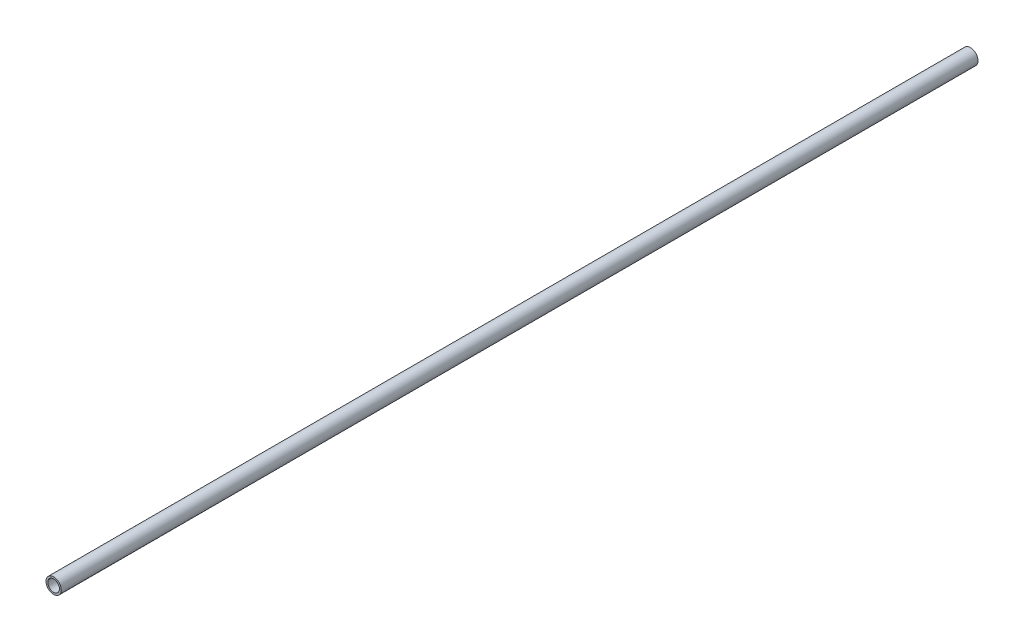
ISO-10303-21;
HEADER;
FILE_DESCRIPTION(('STEP AP214'),'2;1');
FILE_NAME('part.step','',(''),(''),'','','');
FILE_SCHEMA(('AUTOMOTIVE_DESIGN { 1 0 10303 214 1 1 1 1 }'));
ENDSEC;
DATA;
#1=APPLICATION_CONTEXT('core data for automotive mechanical design processes');
#2=APPLICATION_PROTOCOL_DEFINITION('international standard','automotive_design',2000,#1);
#3=PRODUCT_CONTEXT('',#1,'mechanical');
#4=PRODUCT('Part','Part','',(#3));
#5=PRODUCT_RELATED_PRODUCT_CATEGORY('part','',(#4));
#6=PRODUCT_DEFINITION_FORMATION('','',#4);
#7=PRODUCT_DEFINITION_CONTEXT('part definition',#1,'design');
#8=PRODUCT_DEFINITION('design','',#6,#7);
#9=PRODUCT_DEFINITION_SHAPE('','',#8);
#10=(LENGTH_UNIT() NAMED_UNIT(*) SI_UNIT(.MILLI.,.METRE.));
#11=(NAMED_UNIT(*) PLANE_ANGLE_UNIT() SI_UNIT($,.RADIAN.));
#12=(NAMED_UNIT(*) SI_UNIT($,.STERADIAN.) SOLID_ANGLE_UNIT());
#13=UNCERTAINTY_MEASURE_WITH_UNIT(LENGTH_MEASURE(1.E-05),#10,'distance_accuracy_value','');
#14=(GEOMETRIC_REPRESENTATION_CONTEXT(3) GLOBAL_UNCERTAINTY_ASSIGNED_CONTEXT((#13)) GLOBAL_UNIT_ASSIGNED_CONTEXT((#10,
#11,#12)) REPRESENTATION_CONTEXT('',''));
#15=CARTESIAN_POINT('',(0.,0.,0.));
#16=DIRECTION('',(0.,0.,1.));
#17=DIRECTION('',(1.,0.,0.));
#18=AXIS2_PLACEMENT_3D('',#15,#16,#17);
#19=CARTESIAN_POINT('',(0.,0.,1500.));
#20=DIRECTION('',(0.,0.,1.));
#21=DIRECTION('',(1.,0.,0.));
#22=AXIS2_PLACEMENT_3D('',#19,#20,#21);
#23=PLANE('',#22);
#24=CARTESIAN_POINT('',(0.,0.,1500.));
#25=DIRECTION('',(0.,0.,1.));
#26=DIRECTION('',(1.,0.,0.));
#27=AXIS2_PLACEMENT_3D('',#24,#25,#26);
#28=CIRCLE('',#27,12.5);
#29=CARTESIAN_POINT('',(12.5,0.,1500.));
#30=VERTEX_POINT('',#29);
#31=EDGE_CURVE('E10',#30,#30,#28,.T.);
#32=ORIENTED_EDGE('',*,*,#31,.T.);
#33=EDGE_LOOP('',(#32));
#34=FACE_BOUND('',#33,.T.);
#35=CARTESIAN_POINT('',(0.,0.,1500.));
#36=DIRECTION('',(0.,0.,1.));
#37=DIRECTION('',(1.,0.,0.));
#38=AXIS2_PLACEMENT_3D('',#35,#36,#37);
#39=CIRCLE('',#38,9.5);
#40=CARTESIAN_POINT('',(9.5,0.,1500.));
#41=VERTEX_POINT('',#40);
#42=EDGE_CURVE('E42',#41,#41,#39,.T.);
#43=ORIENTED_EDGE('',*,*,#42,.F.);
#44=EDGE_LOOP('',(#43));
#45=FACE_BOUND('',#44,.T.);
#46=ADVANCED_FACE('F31',(#34,#45),#23,.T.);
#47=CARTESIAN_POINT('',(0.,0.,0.));
#48=DIRECTION('',(0.,0.,1.));
#49=DIRECTION('',(1.,0.,0.));
#50=AXIS2_PLACEMENT_3D('',#47,#48,#49);
#51=PLANE('',#50);
#52=CARTESIAN_POINT('',(0.,0.,0.));
#53=DIRECTION('',(0.,0.,1.));
#54=DIRECTION('',(1.,0.,0.));
#55=AXIS2_PLACEMENT_3D('',#52,#53,#54);
#56=CIRCLE('',#55,12.5);
#57=CARTESIAN_POINT('',(12.5,0.,0.));
#58=VERTEX_POINT('',#57);
#59=EDGE_CURVE('E35',#58,#58,#56,.T.);
#60=ORIENTED_EDGE('',*,*,#59,.F.);
#61=EDGE_LOOP('',(#60));
#62=FACE_BOUND('',#61,.T.);
#63=CARTESIAN_POINT('',(0.,0.,0.));
#64=DIRECTION('',(0.,0.,1.));
#65=DIRECTION('',(1.,0.,0.));
#66=AXIS2_PLACEMENT_3D('',#63,#64,#65);
#67=CIRCLE('',#66,9.5);
#68=CARTESIAN_POINT('',(9.5,0.,0.));
#69=VERTEX_POINT('',#68);
#70=EDGE_CURVE('E44',#69,#69,#67,.T.);
#71=ORIENTED_EDGE('',*,*,#70,.T.);
#72=EDGE_LOOP('',(#71));
#73=FACE_BOUND('',#72,.T.);
#74=ADVANCED_FACE('F54',(#62,#73),#51,.F.);
#75=CARTESIAN_POINT('',(0.,0.,1500.));
#76=DIRECTION('',(0.,0.,-1.));
#77=DIRECTION('',(-1.,0.,0.));
#78=AXIS2_PLACEMENT_3D('',#75,#76,#77);
#79=CYLINDRICAL_SURFACE('',#78,12.5);
#80=ORIENTED_EDGE('',*,*,#31,.F.);
#81=EDGE_LOOP('',(#80));
#82=FACE_BOUND('',#81,.T.);
#83=ORIENTED_EDGE('',*,*,#59,.T.);
#84=EDGE_LOOP('',(#83));
#85=FACE_BOUND('',#84,.T.);
#86=ADVANCED_FACE('F33',(#82,#85),#79,.T.);
#87=CARTESIAN_POINT('',(0.,0.,1500.));
#88=DIRECTION('',(0.,0.,-1.));
#89=DIRECTION('',(-1.,0.,0.));
#90=AXIS2_PLACEMENT_3D('',#87,#88,#89);
#91=CYLINDRICAL_SURFACE('',#90,9.5);
#92=ORIENTED_EDGE('',*,*,#42,.T.);
#93=EDGE_LOOP('',(#92));
#94=FACE_BOUND('',#93,.T.);
#95=ORIENTED_EDGE('',*,*,#70,.F.);
#96=EDGE_LOOP('',(#95));
#97=FACE_BOUND('',#96,.T.);
#98=ADVANCED_FACE('F50',(#94,#97),#91,.F.);
#99=CLOSED_SHELL('',(#46,#74,#86,#98));
#100=MANIFOLD_SOLID_BREP('B2',#99);
#101=ADVANCED_BREP_SHAPE_REPRESENTATION('',(#18,#100),#14);
#102=SHAPE_DEFINITION_REPRESENTATION(#9,#101);
ENDSEC;
END-ISO-10303-21;
